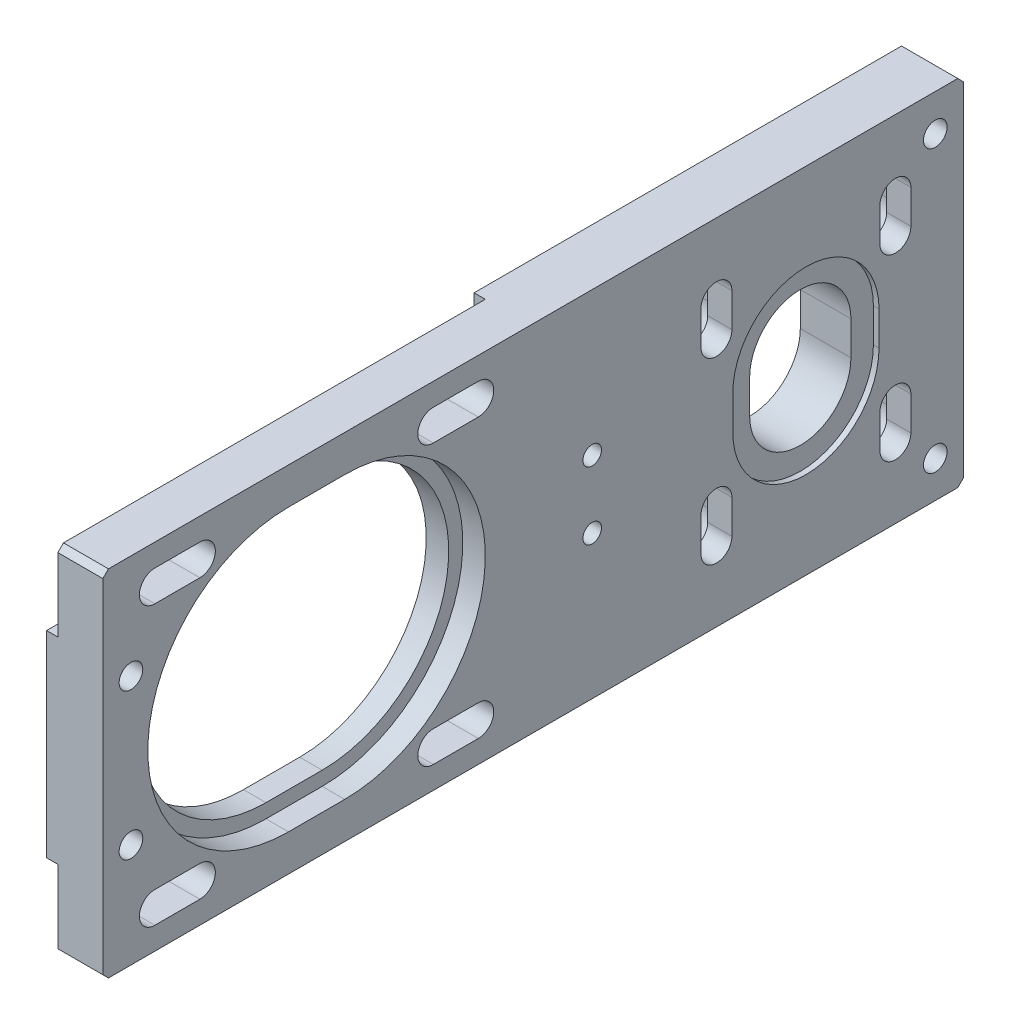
from build123d import *

# Parameters (mm, degrees)
SKETCH_1_W                = 153
SKETCH_1_H                = 63
EXTRUDE_1_DEPTH           = 10
SKETCH_2_R                = 9
CUT_EXTRUDE_1_DEPTH       = 166.76489375
CUT_EXTRUDE_5_DEPTH       = 4
CUT_EXTRUDE_6_DEPTH       = 166.571736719
CUT_EXTRUDE_7_DEPTH       = 2
CUT_EXTRUDE_8_DEPTH       = 166.76489375
HOLE_WIZARD_M4_1_D        = 3.3
HOLE_WIZARD_M5_1_D        = 4.2
HOLE_WIZARD_M5_1_DEPTH    = 12.4
HOLE_WIZARD_M5_1_TIP      = 1.2618073
HOLE_WIZARD_1_D           = 5.5
HOLE_WIZARD_1_CBORE_D     = 10
HOLE_WIZARD_1_CBORE_DEPTH = 5.7
CHAMFER_1_SIZE            = 1
FILLET_2_R                = 2
CUT_EXTRUDE_12_DEPTH      = 5.7
CUT_EXTRUDE_13_DEPTH      = 166.561136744
CUT_EXTRUDE_14_DEPTH      = 166.76489375
CUT_EXTRUDE_15_DEPTH      = 1


with BuildPart() as part:
    # Sketch 1 → Extrude 1 (new body)
    with BuildSketch(Plane(origin=(0, 0, 0), x_dir=(0, 0, -1), z_dir=(1, 0, 0))):
        with Locations((-76.5, 31.5)):
            Rectangle(SKETCH_1_W, SKETCH_1_H)
    extrude(amount=EXTRUDE_1_DEPTH)

    # Sketch 2 → Cut-Extrude 1 (cut, through all)
    with BuildSketch(Plane(origin=(10, 0, 0), x_dir=(0, 0, -1), z_dir=(1, 0, 0))):
        with Locations((-28, 34.5)):
            Circle(SKETCH_2_R)
    extrude(amount=-CUT_EXTRUDE_1_DEPTH, mode=Mode.SUBTRACT)

    # Sketch 11 → Cut-Extrude 5 (cut)
    with BuildSketch(Plane.ZY.offset(-10)):
        with BuildLine():
            Line((120, 6.5), (110, 6.5))
            ThreePointArc((110, 6.5), (85, 31.5), (110, 56.5))
            Line((110, 56.5), (120, 56.5))
            ThreePointArc((120, 56.5), (145, 31.5), (120, 6.5))
        make_face()
    extrude(amount=CUT_EXTRUDE_5_DEPTH, mode=Mode.SUBTRACT)

    # Sketch 12 → Cut-Extrude 6 (cut, through all)
    with BuildSketch(Plane(origin=(6, 0, 0), x_dir=(0, 0, -1), z_dir=(1, 0, 0))):
        with BuildLine():
            Line((-110, 9), (-120, 9))
            ThreePointArc((-120, 9), (-142.5, 31.5), (-120, 54))
            Line((-120, 54), (-110, 54))
            ThreePointArc((-110, 54), (-87.5, 31.5), (-110, 9))
        make_face()
    extrude(amount=-CUT_EXTRUDE_6_DEPTH, mode=Mode.SUBTRACT)

    # Sketch 13 → Cut-Extrude 7 (cut)
    with BuildSketch(Plane.ZY):
        Polygon((153, -1.5), (77, -1.5), (77, 64.5), (153, 64.5), (153, 49), (105.857864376, 49), (105.857864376, 14), (153, 14), align=None)
    extrude(amount=-CUT_EXTRUDE_7_DEPTH, mode=Mode.SUBTRACT)

    # Sketch 14 → Cut-Extrude 8 (cut, through all)
    with BuildSketch(Plane(origin=(10, 0, 0), x_dir=(0, 0, -1), z_dir=(1, 0, 0))):
        with BuildLine():
            Line((-86.251262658, 4.001262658), (-94.251262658, 4.001262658))
            ThreePointArc((-94.251262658, 4.001262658), (-97.001262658, 6.751262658), (-94.251262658, 9.501262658))
            Line((-94.251262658, 9.501262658), (-86.251262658, 9.501262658))
            ThreePointArc((-86.251262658, 9.501262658), (-83.501262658, 6.751262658), (-86.251262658, 4.001262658))
        make_face()
        with BuildLine():
            Line((-86.251262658, 53.498737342), (-94.251262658, 53.498737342))
            ThreePointArc((-94.251262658, 53.498737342), (-97.001262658, 56.248737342), (-94.251262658, 58.998737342))
            Line((-94.251262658, 58.998737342), (-86.251262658, 58.998737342))
            ThreePointArc((-86.251262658, 58.998737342), (-83.501262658, 56.248737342), (-86.251262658, 53.498737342))
        make_face()
        with BuildLine():
            Line((-135.748737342, 53.498737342), (-143.748737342, 53.498737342))
            ThreePointArc((-143.748737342, 53.498737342), (-146.498737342, 56.248737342), (-143.748737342, 58.998737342))
            Line((-143.748737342, 58.998737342), (-135.748737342, 58.998737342))
            ThreePointArc((-135.748737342, 58.998737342), (-132.998737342, 56.248737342), (-135.748737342, 53.498737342))
        make_face()
        with BuildLine():
            Line((-135.748737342, 4.001262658), (-143.748737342, 4.001262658))
            ThreePointArc((-143.748737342, 4.001262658), (-146.498737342, 6.751262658), (-143.748737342, 9.501262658))
            Line((-143.748737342, 9.501262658), (-135.748737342, 9.501262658))
            ThreePointArc((-135.748737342, 9.501262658), (-132.998737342, 6.751262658), (-135.748737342, 4.001262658))
        make_face()
    extrude(amount=-CUT_EXTRUDE_8_DEPTH, mode=Mode.SUBTRACT)

    # Hole Wizard M4 _1 (through all)
    with Locations(Plane.ZY):
        with Locations((66, 37.5), (66, 25.5)):
            Hole(HOLE_WIZARD_M4_1_D / 2)

    # Hole Wizard M5 _1
    with Locations(Plane.ZY):
        with Locations((148, 18.5), (148, 44.5), (5, 6.5), (5, 56.5)):
            Hole(HOLE_WIZARD_M5_1_D / 2, depth=HOLE_WIZARD_M5_1_DEPTH)
            with Locations((0, 0, -(HOLE_WIZARD_M5_1_DEPTH + HOLE_WIZARD_M5_1_TIP / 2))):  # 118° drill point
                Cone(0, HOLE_WIZARD_M5_1_D / 2, HOLE_WIZARD_M5_1_TIP, mode=Mode.SUBTRACT)

    # Hole Wizard 1 (through all)
    with Locations(Plane.ZY):
        with Locations((43.909902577, 18.590097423), (12.090097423, 18.590097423), (12.090097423, 50.409902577), (43.909902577, 50.409902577)):
            CounterBoreHole(HOLE_WIZARD_1_D / 2, HOLE_WIZARD_1_CBORE_D / 2, HOLE_WIZARD_1_CBORE_DEPTH)

    # Chamfer 1
    chamfer_1_edges = [part.edges().sort_by_distance(p)[0] for p in [
        (5, 0, 0),
        (6, 0, 153),
        (6, 63, 153),
        (5, 63, 0),
    ]]
    chamfer(chamfer_1_edges, length=CHAMFER_1_SIZE)

    # Fillet 2
    fillet_2_edges = [part.edges().sort_by_distance(p)[0] for p in [
        (1, 49, 134.142135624),
        (1, 14, 134.142135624),
    ]]
    fillet(fillet_2_edges, radius=FILLET_2_R)

    # Sketch 25 → Cut-Extrude 12 (cut)
    with BuildSketch(Plane.ZY):
        with BuildLine():
            Line((48.909902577, 18.590097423), (48.909902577, 12.590097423))
            ThreePointArc((48.909902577, 12.590097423), (43.909902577, 7.590097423), (38.909902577, 12.590097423))
            Line((38.909902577, 12.590097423), (38.909902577, 18.590097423))
            ThreePointArc((38.909902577, 18.590097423), (43.909902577, 23.590097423), (48.909902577, 18.590097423))
        make_face()
        with BuildLine():
            Line((17.090097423, 18.590097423), (17.090097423, 12.590097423))
            ThreePointArc((17.090097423, 12.590097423), (12.090097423, 7.590097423), (7.090097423, 12.590097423))
            Line((7.090097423, 12.590097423), (7.090097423, 18.590097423))
            ThreePointArc((7.090097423, 18.590097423), (12.090097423, 23.590097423), (17.090097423, 18.590097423))
        make_face()
        with BuildLine():
            Line((48.909902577, 50.409902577), (48.909902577, 44.409902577))
            ThreePointArc((48.909902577, 44.409902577), (43.909902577, 39.409902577), (38.909902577, 44.409902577))
            Line((38.909902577, 44.409902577), (38.909902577, 50.409902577))
            ThreePointArc((38.909902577, 50.409902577), (43.909902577, 55.409902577), (48.909902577, 50.409902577))
        make_face()
        with BuildLine():
            Line((17.090097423, 50.409902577), (17.090097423, 44.409902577))
            ThreePointArc((17.090097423, 44.409902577), (12.090097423, 39.409902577), (7.090097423, 44.409902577))
            Line((7.090097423, 44.409902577), (7.090097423, 50.409902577))
            ThreePointArc((7.090097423, 50.409902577), (12.090097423, 55.409902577), (17.090097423, 50.409902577))
        make_face()
    extrude(amount=-CUT_EXTRUDE_12_DEPTH, mode=Mode.SUBTRACT)

    # Sketch 26 → Cut-Extrude 13 (cut, through all)
    with BuildSketch(Plane.ZY.offset(-5.7)):
        with BuildLine():
            Line((46.659902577, 18.590097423), (46.659902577, 12.590097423))
            ThreePointArc((46.659902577, 12.590097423), (43.909902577, 9.840097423), (41.159902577, 12.590097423))
            Line((41.159902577, 12.590097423), (41.159902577, 18.590097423))
            ThreePointArc((41.159902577, 18.590097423), (43.909902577, 21.340097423), (46.659902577, 18.590097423))
        make_face()
        with BuildLine():
            Line((14.840097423, 18.590097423), (14.840097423, 12.590097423))
            ThreePointArc((14.840097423, 12.590097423), (12.090097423, 9.840097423), (9.340097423, 12.590097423))
            Line((9.340097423, 12.590097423), (9.340097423, 18.590097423))
            ThreePointArc((9.340097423, 18.590097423), (12.090097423, 21.340097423), (14.840097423, 18.590097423))
        make_face()
        with BuildLine():
            Line((46.659902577, 50.409902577), (46.659902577, 44.409902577))
            ThreePointArc((46.659902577, 44.409902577), (43.909902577, 41.659902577), (41.159902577, 44.409902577))
            Line((41.159902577, 44.409902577), (41.159902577, 50.409902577))
            ThreePointArc((41.159902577, 50.409902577), (43.909902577, 53.159902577), (46.659902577, 50.409902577))
        make_face()
        with BuildLine():
            Line((14.840097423, 50.409902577), (14.840097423, 44.409902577))
            ThreePointArc((14.840097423, 44.409902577), (12.090097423, 41.659902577), (9.340097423, 44.409902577))
            Line((9.340097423, 44.409902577), (9.340097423, 50.409902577))
            ThreePointArc((9.340097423, 50.409902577), (12.090097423, 53.159902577), (14.840097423, 50.409902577))
        make_face()
    extrude(amount=-CUT_EXTRUDE_13_DEPTH, mode=Mode.SUBTRACT)

    # Sketch 27 → Cut-Extrude 14 (cut, through all)
    with BuildSketch(Plane.ZY):
        with BuildLine():
            Line((37, 34.5), (37, 28.5))
            ThreePointArc((37, 28.5), (28, 19.5), (19, 28.5))
            Line((19, 28.5), (19, 34.5))
            ThreePointArc((19, 34.5), (28, 43.5), (37, 34.5))
        make_face()
    extrude(amount=-CUT_EXTRUDE_14_DEPTH, mode=Mode.SUBTRACT)

    # Sketch 28 → Cut-Extrude 15 (cut)
    with BuildSketch(Plane(origin=(10, 0, 0), x_dir=(0, 0, -1), z_dir=(1, 0, 0))):
        with BuildLine():
            Line((-15, 34.5), (-15, 28.5))
            ThreePointArc((-15, 28.5), (-28, 15.5), (-41, 28.5))
            Line((-41, 28.5), (-41, 34.5))
            ThreePointArc((-41, 34.5), (-28, 47.5), (-15, 34.5))
        make_face()
    extrude(amount=-CUT_EXTRUDE_15_DEPTH, mode=Mode.SUBTRACT)


solid = part.part
